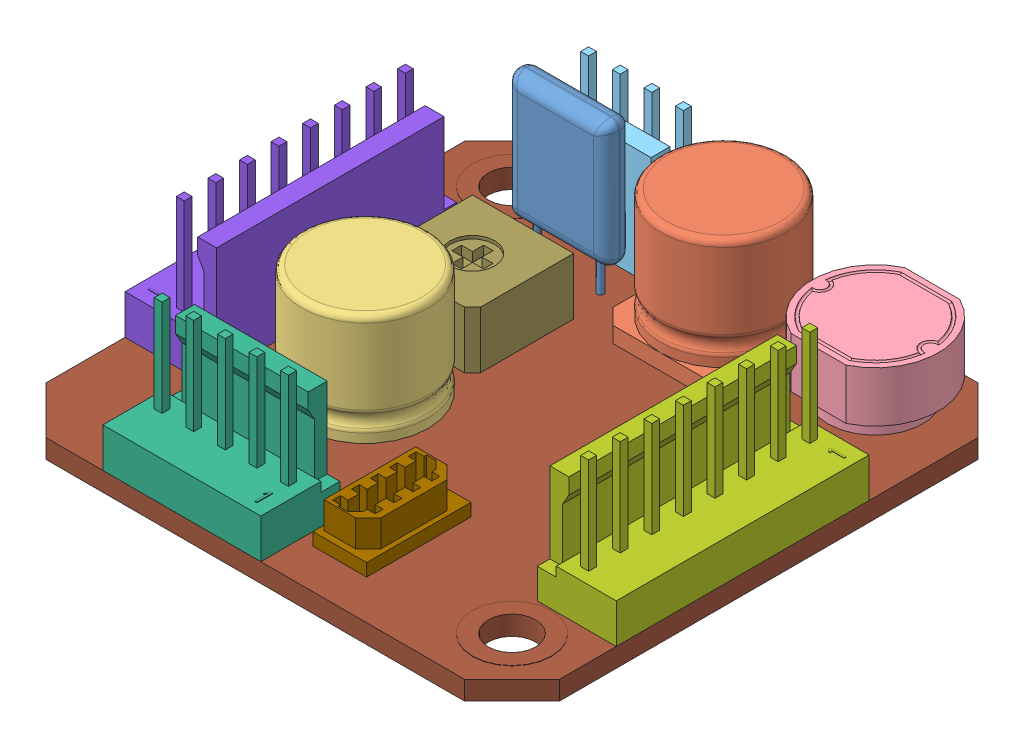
SolidWorks assembly EZHR17EN.sldasm, configuration Default (file format 9000). Lengths in mm.
Overall size (41.27 17.02 41.27).
12 component instances, 12 part files, 0 mates.
Components (placement in the parent):
- CAPACITOR_111-1: CAPACITOR_111.sldprt [Default] at origin size (8.14 16.51 2.22)
- COIL_2-1: COIL_2.sldprt [Default] at origin size (10.16 10.16 10.16)
- COIL_2_1-1: COIL_2_1.sldprt [Default] at origin size (10.16 10.16 10.16)
- COIL_6-1: COIL_6.sldprt [Default] at origin size (10.16 5.59 9.14)
- CONNECTOR_4PIN-1: CONNECTOR_4PIN.sldprt [Default] at origin size (10.16 13.97 6.35)
- CONNECTOR_5PIN-1: CONNECTOR_5PIN.sldprt [Default] at origin size (12.7 13.97 6.35)
- CONNECTOR_8PIN-1: CONNECTOR_8PIN.sldprt [Default] at origin size (6.35 13.97 20.32)
- CONNECTOR_8PIN_1-1: CONNECTOR_8PIN_1.sldprt [Default] at origin size (6.35 13.97 20.32)
- CONNECTOR_9-1: CONNECTOR_9.sldprt [Default] at origin size (4.32 3.17 8.38)
- IC-1: IC.sldprt [Default] at origin size (3.18 2.79 5.71)
- PCB_1-1: PCB_1.sldprt [Default] at origin size (41.27 1.55 41.27)
- POT_11-1: POT_11.sldprt [Default] at origin size (8.13 4.57 8.13)
